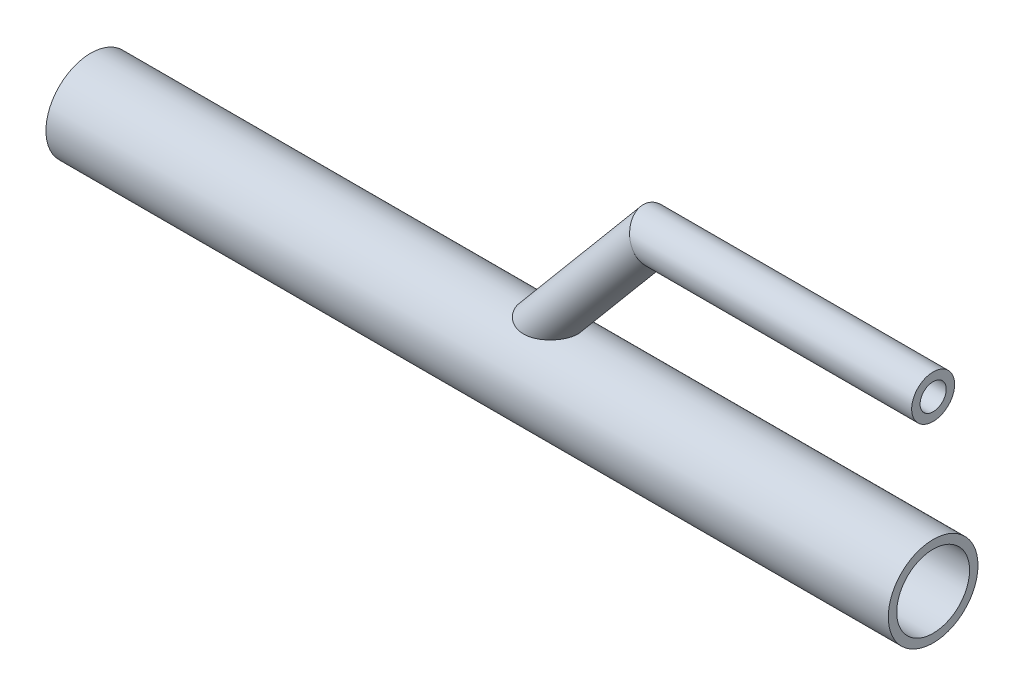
from build123d import *

# Parameters (mm, degrees)
SKIZZE11_R                = 10.65
SKIZZE11_R_2              = 8.65
STRUKTURBAUTEIL1_DEPTH    = 200
SKIZZE12_R                = 5.1
SKIZZE12_R_2              = 3.1
STRUKTURBAUTEIL2_DEPTH    = 56.579530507
SKIZZE12_ON_SEGMENT_2_R   = 5.1
SKIZZE12_ON_SEGMENT_2_R_2 = 3.1
STRUKTURBAUTEIL2_2_DEPTH  = 70.799253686


with BuildPart() as part:
    # Skizze11 → Strukturbauteil1 (new body)
    with BuildSketch(Plane(origin=(0, 0, 0), x_dir=(0, 0, -1), z_dir=(1, 0, 0))):
        Circle(SKIZZE11_R)
        Circle(SKIZZE11_R_2, mode=Mode.SUBTRACT)
    extrude(amount=STRUKTURBAUTEIL1_DEPTH)


with BuildPart() as body_2:
    # Skizze12 → Strukturbauteil2 (new body)
    with BuildSketch(Plane(origin=(100, 0, 0), x_dir=(0.5868240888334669, -0.49240387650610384, -0.642787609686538), z_dir=(0.6427876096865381, 0.7660444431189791, 0))):
        Circle(SKIZZE12_R)
        Circle(SKIZZE12_R_2, mode=Mode.SUBTRACT)
    extrude(amount=STRUKTURBAUTEIL2_DEPTH)

    # Strukturbauteil2 mitre 1
    split(bisect_by=Plane(origin=(133.563985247, 40, 0), x_dir=(0.422618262, -0.906307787, 0), z_dir=(-0.906307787, -0.422618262, 0)), keep=Keep.TOP)

    # Trimmen_Verl_ngern1: cut back where it meets the other member's skin (coped)
    split(bisect_by=part.part.faces().sort_by_distance((100, 0, 10.65))[0], keep=Keep.TOP)


with BuildPart() as body_3:
    # Skizze12 on segment 2 (on carried to segment 2) → Strukturbauteil2 2 (new body)
    with BuildSketch(Plane(origin=(129.200746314, 40, 0), x_dir=(0, -0.766044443, -0.64278761), z_dir=(1, 0, 0))):
        Circle(SKIZZE12_ON_SEGMENT_2_R)
        Circle(SKIZZE12_ON_SEGMENT_2_R_2, mode=Mode.SUBTRACT)
    extrude(amount=STRUKTURBAUTEIL2_2_DEPTH)

    # Strukturbauteil2 2 mitre 1
    split(bisect_by=Plane(origin=(133.563985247, 40, 0), x_dir=(-0.422618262, 0.906307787, 0), z_dir=(0.906307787, 0.422618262, 0)), keep=Keep.TOP)


solid = Compound([part.part, body_2.part, body_3.part])
